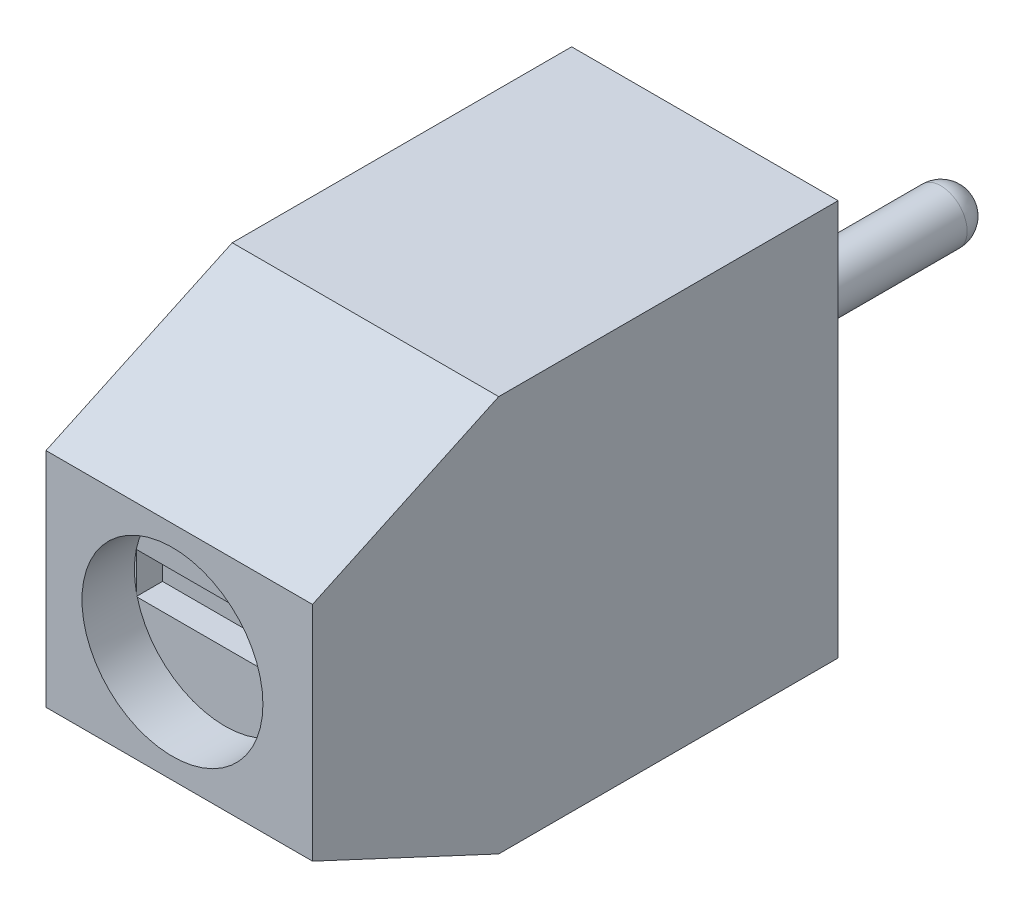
ISO-10303-21;
HEADER;
FILE_DESCRIPTION(('STEP AP214'),'2;1');
FILE_NAME('part.step','',(''),(''),'','','');
FILE_SCHEMA(('AUTOMOTIVE_DESIGN { 1 0 10303 214 1 1 1 1 }'));
ENDSEC;
DATA;
#1=APPLICATION_CONTEXT('core data for automotive mechanical design processes');
#2=APPLICATION_PROTOCOL_DEFINITION('international standard','automotive_design',2000,#1);
#3=PRODUCT_CONTEXT('',#1,'mechanical');
#4=PRODUCT('Part','Part','',(#3));
#5=PRODUCT_RELATED_PRODUCT_CATEGORY('part','',(#4));
#6=PRODUCT_DEFINITION_FORMATION('','',#4);
#7=PRODUCT_DEFINITION_CONTEXT('part definition',#1,'design');
#8=PRODUCT_DEFINITION('design','',#6,#7);
#9=PRODUCT_DEFINITION_SHAPE('','',#8);
#10=(LENGTH_UNIT() NAMED_UNIT(*) SI_UNIT(.MILLI.,.METRE.));
#11=(NAMED_UNIT(*) PLANE_ANGLE_UNIT() SI_UNIT($,.RADIAN.));
#12=(NAMED_UNIT(*) SI_UNIT($,.STERADIAN.) SOLID_ANGLE_UNIT());
#13=UNCERTAINTY_MEASURE_WITH_UNIT(LENGTH_MEASURE(1.E-05),#10,'distance_accuracy_value','');
#14=(GEOMETRIC_REPRESENTATION_CONTEXT(3) GLOBAL_UNCERTAINTY_ASSIGNED_CONTEXT((#13)) GLOBAL_UNIT_ASSIGNED_CONTEXT((#10,
#11,#12)) REPRESENTATION_CONTEXT('',''));
#15=CARTESIAN_POINT('',(0.,0.,0.));
#16=DIRECTION('',(0.,0.,1.));
#17=DIRECTION('',(1.,0.,0.));
#18=AXIS2_PLACEMENT_3D('',#15,#16,#17);
#19=CARTESIAN_POINT('',(2.535,3.2,3.23499999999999));
#20=DIRECTION('',(0.,-1.,0.));
#21=DIRECTION('',(0.,0.,-1.));
#22=AXIS2_PLACEMENT_3D('',#19,#20,#21);
#23=PLANE('',#22);
#24=DIRECTION('',(0.,0.,1.));
#25=VECTOR('',#24,1.);
#26=CARTESIAN_POINT('',(4.13961086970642,3.2,3.75756951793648));
#27=LINE('',#26,#25);
#28=CARTESIAN_POINT('',(4.13961086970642,3.2,2.75453256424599));
#29=VERTEX_POINT('',#28);
#30=CARTESIAN_POINT('',(4.13961086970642,3.2,3.71546743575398));
#31=VERTEX_POINT('',#30);
#32=EDGE_CURVE('E241',#29,#31,#27,.T.);
#33=ORIENTED_EDGE('',*,*,#32,.F.);
#34=CARTESIAN_POINT('',(2.535,3.2,3.23499999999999));
#35=DIRECTION('',(0.,-1.,0.));
#36=DIRECTION('',(0.,0.,-1.));
#37=AXIS2_PLACEMENT_3D('',#34,#35,#36);
#38=CIRCLE('',#37,1.675);
#39=EDGE_CURVE('E324',#29,#31,#38,.T.);
#40=ORIENTED_EDGE('',*,*,#39,.T.);
#41=EDGE_LOOP('',(#33,#40));
#42=FACE_BOUND('',#41,.T.);
#43=ADVANCED_FACE('F26',(#42),#23,.T.);
#44=DIRECTION('',(1.,0.,0.));
#45=VECTOR('',#44,1.);
#46=CARTESIAN_POINT('',(0.943602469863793,3.2,2.75453256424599));
#47=LINE('',#46,#45);
#48=CARTESIAN_POINT('',(0.943602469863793,3.2,2.75453256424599));
#49=VERTEX_POINT('',#48);
#50=EDGE_CURVE('E245',#49,#29,#47,.T.);
#51=ORIENTED_EDGE('',*,*,#50,.F.);
#52=DIRECTION('',(0.,0.,-1.));
#53=VECTOR('',#52,1.);
#54=CARTESIAN_POINT('',(0.943602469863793,3.2,3.75756951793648));
#55=LINE('',#54,#53);
#56=CARTESIAN_POINT('',(0.943602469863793,3.2,3.75756951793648));
#57=VERTEX_POINT('',#56);
#58=EDGE_CURVE('E169',#57,#49,#55,.T.);
#59=ORIENTED_EDGE('',*,*,#58,.F.);
#60=EDGE_CURVE('E328',#57,#29,#38,.T.);
#61=ORIENTED_EDGE('',*,*,#60,.T.);
#62=EDGE_LOOP('',(#51,#59,#61));
#63=FACE_BOUND('',#62,.T.);
#64=ADVANCED_FACE('F387',(#63),#23,.T.);
#65=CARTESIAN_POINT('',(2.41012041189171,3.775,9.02));
#66=DIRECTION('',(0.,0.,1.));
#67=DIRECTION('',(1.,0.,0.));
#68=AXIS2_PLACEMENT_3D('',#65,#66,#67);
#69=PLANE('',#68);
#70=DIRECTION('',(0.,-1.,0.));
#71=VECTOR('',#70,1.);
#72=CARTESIAN_POINT('',(0.720954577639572,4.12477676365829,9.02));
#73=LINE('',#72,#71);
#74=CARTESIAN_POINT('',(0.720954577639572,4.12477676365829,9.02));
#75=VERTEX_POINT('',#74);
#76=CARTESIAN_POINT('',(0.720954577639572,3.42522323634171,9.02));
#77=VERTEX_POINT('',#76);
#78=EDGE_CURVE('E210',#75,#77,#73,.T.);
#79=ORIENTED_EDGE('',*,*,#78,.F.);
#80=CARTESIAN_POINT('',(2.41012041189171,3.775,9.02));
#81=DIRECTION('',(0.,0.,1.));
#82=DIRECTION('',(1.,0.,0.));
#83=AXIS2_PLACEMENT_3D('',#80,#81,#82);
#84=CIRCLE('',#83,1.725);
#85=EDGE_CURVE('E282',#75,#77,#84,.T.);
#86=ORIENTED_EDGE('',*,*,#85,.T.);
#87=EDGE_LOOP('',(#79,#86));
#88=FACE_BOUND('',#87,.T.);
#89=ADVANCED_FACE('F366',(#88),#69,.T.);
#90=DIRECTION('',(1.,0.,0.));
#91=VECTOR('',#90,1.);
#92=CARTESIAN_POINT('',(0.720954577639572,3.34472594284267,9.02));
#93=LINE('',#92,#91);
#94=CARTESIAN_POINT('',(0.73964466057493,3.34472594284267,9.02));
#95=VERTEX_POINT('',#94);
#96=CARTESIAN_POINT('',(4.08059616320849,3.34472594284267,9.02));
#97=VERTEX_POINT('',#96);
#98=EDGE_CURVE('E197',#95,#97,#93,.T.);
#99=ORIENTED_EDGE('',*,*,#98,.F.);
#100=EDGE_CURVE('E373',#95,#97,#84,.T.);
#101=ORIENTED_EDGE('',*,*,#100,.T.);
#102=EDGE_LOOP('',(#99,#101));
#103=FACE_BOUND('',#102,.T.);
#104=ADVANCED_FACE('F378',(#103),#69,.T.);
#105=CARTESIAN_POINT('',(0.,0.,0.));
#106=DIRECTION('',(0.,0.,-1.));
#107=DIRECTION('',(-1.,0.,0.));
#108=AXIS2_PLACEMENT_3D('',#105,#106,#107);
#109=PLANE('',#108);
#110=DIRECTION('',(0.,1.,0.));
#111=VECTOR('',#110,1.);
#112=CARTESIAN_POINT('',(5.08,0.,0.));
#113=LINE('',#112,#111);
#114=CARTESIAN_POINT('',(5.08,0.,0.));
#115=VERTEX_POINT('',#114);
#116=CARTESIAN_POINT('',(5.08,7.55,0.));
#117=VERTEX_POINT('',#116);
#118=EDGE_CURVE('E251',#115,#117,#113,.T.);
#119=ORIENTED_EDGE('',*,*,#118,.F.);
#120=DIRECTION('',(1.,0.,0.));
#121=VECTOR('',#120,1.);
#122=CARTESIAN_POINT('',(0.,0.,0.));
#123=LINE('',#122,#121);
#124=CARTESIAN_POINT('',(0.,0.,0.));
#125=VERTEX_POINT('',#124);
#126=EDGE_CURVE('E260',#125,#115,#123,.T.);
#127=ORIENTED_EDGE('',*,*,#126,.F.);
#128=DIRECTION('',(0.,-1.,0.));
#129=VECTOR('',#128,1.);
#130=CARTESIAN_POINT('',(0.,0.,0.));
#131=LINE('',#130,#129);
#132=CARTESIAN_POINT('',(0.,7.55,0.));
#133=VERTEX_POINT('',#132);
#134=EDGE_CURVE('E280',#133,#125,#131,.T.);
#135=ORIENTED_EDGE('',*,*,#134,.F.);
#136=DIRECTION('',(-1.,0.,0.));
#137=VECTOR('',#136,1.);
#138=CARTESIAN_POINT('',(0.,7.55,0.));
#139=LINE('',#138,#137);
#140=EDGE_CURVE('E269',#117,#133,#139,.T.);
#141=ORIENTED_EDGE('',*,*,#140,.F.);
#142=EDGE_LOOP('',(#119,#127,#135,#141));
#143=FACE_BOUND('',#142,.T.);
#144=CARTESIAN_POINT('',(2.54,3.775,0.));
#145=DIRECTION('',(0.,0.,-1.));
#146=DIRECTION('',(-1.,0.,0.));
#147=AXIS2_PLACEMENT_3D('',#144,#145,#146);
#148=CIRCLE('',#147,0.5);
#149=CARTESIAN_POINT('',(2.04,3.775,0.));
#150=VERTEX_POINT('',#149);
#151=EDGE_CURVE('E332',#150,#150,#148,.T.);
#152=ORIENTED_EDGE('',*,*,#151,.F.);
#153=EDGE_LOOP('',(#152));
#154=FACE_BOUND('',#153,.T.);
#155=ADVANCED_FACE('F277',(#143,#154),#109,.T.);
#156=CARTESIAN_POINT('',(0.,0.,10.02));
#157=DIRECTION('',(1.,0.,0.));
#158=DIRECTION('',(0.,0.,-1.));
#159=AXIS2_PLACEMENT_3D('',#156,#157,#158);
#160=PLANE('',#159);
#161=DIRECTION('',(0.,-1.,0.));
#162=VECTOR('',#161,1.);
#163=CARTESIAN_POINT('',(0.,0.,10.02));
#164=LINE('',#163,#162);
#165=CARTESIAN_POINT('',(0.,5.89460781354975,10.02));
#166=VERTEX_POINT('',#165);
#167=CARTESIAN_POINT('',(0.,1.65539218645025,10.02));
#168=VERTEX_POINT('',#167);
#169=EDGE_CURVE('E266',#166,#168,#164,.T.);
#170=ORIENTED_EDGE('',*,*,#169,.F.);
#171=DIRECTION('',(0.,-0.422618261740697,0.906307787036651));
#172=VECTOR('',#171,1.);
#173=CARTESIAN_POINT('',(0.,5.89460781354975,10.02));
#174=LINE('',#173,#172);
#175=CARTESIAN_POINT('',(0.,7.55,6.46999999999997));
#176=VERTEX_POINT('',#175);
#177=EDGE_CURVE('E182',#166,#176,#174,.F.);
#178=ORIENTED_EDGE('',*,*,#177,.T.);
#179=DIRECTION('',(0.,0.,-1.));
#180=VECTOR('',#179,1.);
#181=CARTESIAN_POINT('',(0.,7.55,10.02));
#182=LINE('',#181,#180);
#183=EDGE_CURVE('E268',#176,#133,#182,.T.);
#184=ORIENTED_EDGE('',*,*,#183,.T.);
#185=ORIENTED_EDGE('',*,*,#134,.T.);
#186=DIRECTION('',(0.,0.,-1.));
#187=VECTOR('',#186,1.);
#188=CARTESIAN_POINT('',(0.,0.,10.02));
#189=LINE('',#188,#187);
#190=CARTESIAN_POINT('',(0.,0.,6.46999999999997));
#191=VERTEX_POINT('',#190);
#192=EDGE_CURVE('E187',#191,#125,#189,.T.);
#193=ORIENTED_EDGE('',*,*,#192,.F.);
#194=DIRECTION('',(0.,-0.422618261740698,-0.906307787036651));
#195=VECTOR('',#194,1.);
#196=CARTESIAN_POINT('',(0.,1.65539218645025,10.02));
#197=LINE('',#196,#195);
#198=EDGE_CURVE('E184',#191,#168,#197,.F.);
#199=ORIENTED_EDGE('',*,*,#198,.T.);
#200=EDGE_LOOP('',(#170,#178,#184,#185,#193,#199));
#201=FACE_BOUND('',#200,.T.);
#202=ADVANCED_FACE('F28',(#201),#160,.F.);
#203=CARTESIAN_POINT('',(0.,0.,10.02));
#204=DIRECTION('',(0.,1.,0.));
#205=DIRECTION('',(0.,0.,1.));
#206=AXIS2_PLACEMENT_3D('',#203,#204,#205);
#207=PLANE('',#206);
#208=DIRECTION('',(-1.,0.,0.));
#209=VECTOR('',#208,1.);
#210=CARTESIAN_POINT('',(4.63,0.,5.8));
#211=LINE('',#210,#209);
#212=CARTESIAN_POINT('',(4.63,0.,5.8));
#213=VERTEX_POINT('',#212);
#214=CARTESIAN_POINT('',(0.629999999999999,0.,5.8));
#215=VERTEX_POINT('',#214);
#216=EDGE_CURVE('E319',#213,#215,#211,.T.);
#217=ORIENTED_EDGE('',*,*,#216,.F.);
#218=DIRECTION('',(0.,0.,1.));
#219=VECTOR('',#218,1.);
#220=CARTESIAN_POINT('',(4.63,0.,5.8));
#221=LINE('',#220,#219);
#222=CARTESIAN_POINT('',(4.63,0.,0.800000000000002));
#223=VERTEX_POINT('',#222);
#224=EDGE_CURVE('E322',#223,#213,#221,.T.);
#225=ORIENTED_EDGE('',*,*,#224,.F.);
#226=DIRECTION('',(1.,0.,0.));
#227=VECTOR('',#226,1.);
#228=CARTESIAN_POINT('',(4.63,0.,0.800000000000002));
#229=LINE('',#228,#227);
#230=CARTESIAN_POINT('',(0.63,0.,0.800000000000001));
#231=VERTEX_POINT('',#230);
#232=EDGE_CURVE('E313',#231,#223,#229,.T.);
#233=ORIENTED_EDGE('',*,*,#232,.F.);
#234=DIRECTION('',(0.,0.,-1.));
#235=VECTOR('',#234,1.);
#236=CARTESIAN_POINT('',(0.629999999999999,0.,5.8));
#237=LINE('',#236,#235);
#238=EDGE_CURVE('E316',#215,#231,#237,.T.);
#239=ORIENTED_EDGE('',*,*,#238,.F.);
#240=EDGE_LOOP('',(#217,#225,#233,#239));
#241=FACE_BOUND('',#240,.T.);
#242=ORIENTED_EDGE('',*,*,#126,.T.);
#243=DIRECTION('',(0.,0.,1.));
#244=VECTOR('',#243,1.);
#245=CARTESIAN_POINT('',(5.08,0.,10.02));
#246=LINE('',#245,#244);
#247=CARTESIAN_POINT('',(5.08,0.,6.46999999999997));
#248=VERTEX_POINT('',#247);
#249=EDGE_CURVE('E179',#115,#248,#246,.T.);
#250=ORIENTED_EDGE('',*,*,#249,.T.);
#251=DIRECTION('',(-1.,0.,0.));
#252=VECTOR('',#251,1.);
#253=CARTESIAN_POINT('',(0.,0.,6.46999999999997));
#254=LINE('',#253,#252);
#255=EDGE_CURVE('E194',#248,#191,#254,.T.);
#256=ORIENTED_EDGE('',*,*,#255,.T.);
#257=ORIENTED_EDGE('',*,*,#192,.T.);
#258=EDGE_LOOP('',(#242,#250,#256,#257));
#259=FACE_BOUND('',#258,.T.);
#260=ADVANCED_FACE('F257',(#241,#259),#207,.F.);
#261=CARTESIAN_POINT('',(0.,7.55,10.02));
#262=DIRECTION('',(0.,-1.,0.));
#263=DIRECTION('',(1.,0.,0.));
#264=AXIS2_PLACEMENT_3D('',#261,#262,#263);
#265=PLANE('',#264);
#266=DIRECTION('',(1.,0.,0.));
#267=VECTOR('',#266,1.);
#268=CARTESIAN_POINT('',(0.,7.55,6.46999999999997));
#269=LINE('',#268,#267);
#270=CARTESIAN_POINT('',(5.08,7.55,6.46999999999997));
#271=VERTEX_POINT('',#270);
#272=EDGE_CURVE('E192',#176,#271,#269,.T.);
#273=ORIENTED_EDGE('',*,*,#272,.T.);
#274=DIRECTION('',(0.,0.,-1.));
#275=VECTOR('',#274,1.);
#276=CARTESIAN_POINT('',(5.08,7.55,10.02));
#277=LINE('',#276,#275);
#278=EDGE_CURVE('E164',#271,#117,#277,.T.);
#279=ORIENTED_EDGE('',*,*,#278,.T.);
#280=ORIENTED_EDGE('',*,*,#140,.T.);
#281=ORIENTED_EDGE('',*,*,#183,.F.);
#282=EDGE_LOOP('',(#273,#279,#280,#281));
#283=FACE_BOUND('',#282,.T.);
#284=ADVANCED_FACE('F564',(#283),#265,.F.);
#285=CARTESIAN_POINT('',(0.,0.,10.02));
#286=DIRECTION('',(0.,0.,-1.));
#287=DIRECTION('',(-1.,0.,0.));
#288=AXIS2_PLACEMENT_3D('',#285,#286,#287);
#289=PLANE('',#288);
#290=CARTESIAN_POINT('',(2.41012041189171,3.775,10.02));
#291=DIRECTION('',(0.,0.,1.));
#292=DIRECTION('',(1.,0.,0.));
#293=AXIS2_PLACEMENT_3D('',#290,#291,#292);
#294=CIRCLE('',#293,1.725);
#295=CARTESIAN_POINT('',(4.13512041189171,3.775,10.02));
#296=VERTEX_POINT('',#295);
#297=EDGE_CURVE('E289',#296,#296,#294,.T.);
#298=ORIENTED_EDGE('',*,*,#297,.F.);
#299=EDGE_LOOP('',(#298));
#300=FACE_BOUND('',#299,.T.);
#301=DIRECTION('',(1.,0.,0.));
#302=VECTOR('',#301,1.);
#303=CARTESIAN_POINT('',(0.,1.65539218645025,10.02));
#304=LINE('',#303,#302);
#305=CARTESIAN_POINT('',(5.08,1.65539218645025,10.02));
#306=VERTEX_POINT('',#305);
#307=EDGE_CURVE('E178',#168,#306,#304,.T.);
#308=ORIENTED_EDGE('',*,*,#307,.T.);
#309=DIRECTION('',(0.,-1.,0.));
#310=VECTOR('',#309,1.);
#311=CARTESIAN_POINT('',(5.08,9.15549118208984,10.02));
#312=LINE('',#311,#310);
#313=CARTESIAN_POINT('',(5.08,5.89460781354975,10.02));
#314=VERTEX_POINT('',#313);
#315=EDGE_CURVE('E40',#314,#306,#312,.T.);
#316=ORIENTED_EDGE('',*,*,#315,.F.);
#317=DIRECTION('',(-1.,0.,0.));
#318=VECTOR('',#317,1.);
#319=CARTESIAN_POINT('',(0.,5.89460781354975,10.02));
#320=LINE('',#319,#318);
#321=EDGE_CURVE('E175',#314,#166,#320,.T.);
#322=ORIENTED_EDGE('',*,*,#321,.T.);
#323=ORIENTED_EDGE('',*,*,#169,.T.);
#324=EDGE_LOOP('',(#308,#316,#322,#323));
#325=FACE_BOUND('',#324,.T.);
#326=ADVANCED_FACE('F173',(#300,#325),#289,.F.);
#327=CARTESIAN_POINT('',(0.,5.89460781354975,10.02));
#328=DIRECTION('',(0.,-0.906307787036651,-0.422618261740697));
#329=DIRECTION('',(0.,0.422618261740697,-0.906307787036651));
#330=AXIS2_PLACEMENT_3D('',#327,#328,#329);
#331=PLANE('',#330);
#332=DIRECTION('',(0.,0.422618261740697,-0.906307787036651));
#333=VECTOR('',#332,1.);
#334=CARTESIAN_POINT('',(5.08,5.89460781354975,10.02));
#335=LINE('',#334,#333);
#336=EDGE_CURVE('E161',#271,#314,#335,.F.);
#337=ORIENTED_EDGE('',*,*,#336,.F.);
#338=ORIENTED_EDGE('',*,*,#272,.F.);
#339=ORIENTED_EDGE('',*,*,#177,.F.);
#340=ORIENTED_EDGE('',*,*,#321,.F.);
#341=EDGE_LOOP('',(#337,#338,#339,#340));
#342=FACE_BOUND('',#341,.T.);
#343=ADVANCED_FACE('F181',(#342),#331,.F.);
#344=CARTESIAN_POINT('',(0.,1.65539218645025,10.02));
#345=DIRECTION('',(0.,0.906307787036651,-0.422618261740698));
#346=DIRECTION('',(0.,0.422618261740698,0.906307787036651));
#347=AXIS2_PLACEMENT_3D('',#344,#345,#346);
#348=PLANE('',#347);
#349=DIRECTION('',(0.,0.422618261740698,0.906307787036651));
#350=VECTOR('',#349,1.);
#351=CARTESIAN_POINT('',(5.08,1.65539218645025,10.02));
#352=LINE('',#351,#350);
#353=EDGE_CURVE('E11',#306,#248,#352,.F.);
#354=ORIENTED_EDGE('',*,*,#353,.F.);
#355=ORIENTED_EDGE('',*,*,#307,.F.);
#356=ORIENTED_EDGE('',*,*,#198,.F.);
#357=ORIENTED_EDGE('',*,*,#255,.F.);
#358=EDGE_LOOP('',(#354,#355,#356,#357));
#359=FACE_BOUND('',#358,.T.);
#360=ADVANCED_FACE('F264',(#359),#348,.F.);
#361=CARTESIAN_POINT('',(2.41012041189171,3.775,9.02));
#362=DIRECTION('',(0.,0.,1.));
#363=DIRECTION('',(1.,0.,0.));
#364=AXIS2_PLACEMENT_3D('',#361,#362,#363);
#365=CYLINDRICAL_SURFACE('',#364,1.725);
#366=ORIENTED_EDGE('',*,*,#85,.F.);
#367=EDGE_CURVE('E287',#97,#75,#84,.T.);
#368=ORIENTED_EDGE('',*,*,#367,.F.);
#369=ORIENTED_EDGE('',*,*,#100,.F.);
#370=EDGE_CURVE('E285',#77,#95,#84,.T.);
#371=ORIENTED_EDGE('',*,*,#370,.F.);
#372=EDGE_LOOP('',(#366,#368,#369,#371));
#373=FACE_BOUND('',#372,.T.);
#374=ORIENTED_EDGE('',*,*,#297,.T.);
#375=EDGE_LOOP('',(#374));
#376=FACE_BOUND('',#375,.T.);
#377=ADVANCED_FACE('F374',(#373,#376),#365,.F.);
#378=DIRECTION('',(0.,1.,0.));
#379=VECTOR('',#378,1.);
#380=CARTESIAN_POINT('',(4.08059616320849,4.12477676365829,9.02));
#381=LINE('',#380,#379);
#382=CARTESIAN_POINT('',(4.08059616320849,4.12477676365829,9.02));
#383=VERTEX_POINT('',#382);
#384=EDGE_CURVE('E209',#97,#383,#381,.T.);
#385=ORIENTED_EDGE('',*,*,#384,.F.);
#386=ORIENTED_EDGE('',*,*,#367,.T.);
#387=DIRECTION('',(-1.,0.,0.));
#388=VECTOR('',#387,1.);
#389=CARTESIAN_POINT('',(0.720954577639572,4.12477676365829,9.02));
#390=LINE('',#389,#388);
#391=EDGE_CURVE('E213',#383,#75,#390,.T.);
#392=ORIENTED_EDGE('',*,*,#391,.F.);
#393=EDGE_LOOP('',(#385,#386,#392));
#394=FACE_BOUND('',#393,.T.);
#395=ADVANCED_FACE('F369',(#394),#69,.T.);
#396=CARTESIAN_POINT('',(4.63,1.6,5.8));
#397=DIRECTION('',(1.,0.,0.));
#398=DIRECTION('',(0.,0.,-1.));
#399=AXIS2_PLACEMENT_3D('',#396,#397,#398);
#400=PLANE('',#399);
#401=ORIENTED_EDGE('',*,*,#224,.T.);
#402=DIRECTION('',(0.,-1.,0.));
#403=VECTOR('',#402,1.);
#404=CARTESIAN_POINT('',(4.63,1.6,5.8));
#405=LINE('',#404,#403);
#406=CARTESIAN_POINT('',(4.63,1.6,5.8));
#407=VERTEX_POINT('',#406);
#408=EDGE_CURVE('E293',#407,#213,#405,.T.);
#409=ORIENTED_EDGE('',*,*,#408,.F.);
#410=DIRECTION('',(0.,0.,1.));
#411=VECTOR('',#410,1.);
#412=CARTESIAN_POINT('',(4.63,1.6,5.8));
#413=LINE('',#412,#411);
#414=CARTESIAN_POINT('',(4.63,1.6,0.800000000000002));
#415=VERTEX_POINT('',#414);
#416=EDGE_CURVE('E310',#415,#407,#413,.T.);
#417=ORIENTED_EDGE('',*,*,#416,.F.);
#418=DIRECTION('',(0.,-1.,0.));
#419=VECTOR('',#418,1.);
#420=CARTESIAN_POINT('',(4.63,1.6,0.800000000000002));
#421=LINE('',#420,#419);
#422=EDGE_CURVE('E292',#415,#223,#421,.T.);
#423=ORIENTED_EDGE('',*,*,#422,.T.);
#424=EDGE_LOOP('',(#401,#409,#417,#423));
#425=FACE_BOUND('',#424,.T.);
#426=ADVANCED_FACE('F391',(#425),#400,.F.);
#427=CARTESIAN_POINT('',(4.63,1.6,0.800000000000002));
#428=DIRECTION('',(0.,0.,-1.));
#429=DIRECTION('',(-1.,0.,0.));
#430=AXIS2_PLACEMENT_3D('',#427,#428,#429);
#431=PLANE('',#430);
#432=ORIENTED_EDGE('',*,*,#232,.T.);
#433=ORIENTED_EDGE('',*,*,#422,.F.);
#434=DIRECTION('',(1.,0.,0.));
#435=VECTOR('',#434,1.);
#436=CARTESIAN_POINT('',(4.63,1.6,0.800000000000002));
#437=LINE('',#436,#435);
#438=CARTESIAN_POINT('',(0.63,1.6,0.800000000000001));
#439=VERTEX_POINT('',#438);
#440=EDGE_CURVE('E297',#439,#415,#437,.T.);
#441=ORIENTED_EDGE('',*,*,#440,.F.);
#442=DIRECTION('',(0.,-1.,0.));
#443=VECTOR('',#442,1.);
#444=CARTESIAN_POINT('',(0.63,1.6,0.800000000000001));
#445=LINE('',#444,#443);
#446=EDGE_CURVE('E299',#439,#231,#445,.T.);
#447=ORIENTED_EDGE('',*,*,#446,.T.);
#448=EDGE_LOOP('',(#432,#433,#441,#447));
#449=FACE_BOUND('',#448,.T.);
#450=ADVANCED_FACE('F614',(#449),#431,.F.);
#451=CARTESIAN_POINT('',(0.629999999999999,1.6,5.8));
#452=DIRECTION('',(-1.,0.,0.));
#453=DIRECTION('',(0.,0.,1.));
#454=AXIS2_PLACEMENT_3D('',#451,#452,#453);
#455=PLANE('',#454);
#456=ORIENTED_EDGE('',*,*,#238,.T.);
#457=ORIENTED_EDGE('',*,*,#446,.F.);
#458=DIRECTION('',(0.,0.,-1.));
#459=VECTOR('',#458,1.);
#460=CARTESIAN_POINT('',(0.629999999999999,1.6,5.8));
#461=LINE('',#460,#459);
#462=CARTESIAN_POINT('',(0.629999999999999,1.6,5.8));
#463=VERTEX_POINT('',#462);
#464=EDGE_CURVE('E304',#463,#439,#461,.T.);
#465=ORIENTED_EDGE('',*,*,#464,.F.);
#466=DIRECTION('',(0.,-1.,0.));
#467=VECTOR('',#466,1.);
#468=CARTESIAN_POINT('',(0.629999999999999,1.6,5.8));
#469=LINE('',#468,#467);
#470=EDGE_CURVE('E296',#463,#215,#469,.T.);
#471=ORIENTED_EDGE('',*,*,#470,.T.);
#472=EDGE_LOOP('',(#456,#457,#465,#471));
#473=FACE_BOUND('',#472,.T.);
#474=ADVANCED_FACE('F606',(#473),#455,.F.);
#475=CARTESIAN_POINT('',(4.63,1.6,5.8));
#476=DIRECTION('',(0.,0.,1.));
#477=DIRECTION('',(1.,0.,0.));
#478=AXIS2_PLACEMENT_3D('',#475,#476,#477);
#479=PLANE('',#478);
#480=ORIENTED_EDGE('',*,*,#216,.T.);
#481=ORIENTED_EDGE('',*,*,#470,.F.);
#482=DIRECTION('',(-1.,0.,0.));
#483=VECTOR('',#482,1.);
#484=CARTESIAN_POINT('',(4.63,1.6,5.8));
#485=LINE('',#484,#483);
#486=EDGE_CURVE('E307',#407,#463,#485,.T.);
#487=ORIENTED_EDGE('',*,*,#486,.F.);
#488=ORIENTED_EDGE('',*,*,#408,.T.);
#489=EDGE_LOOP('',(#480,#481,#487,#488));
#490=FACE_BOUND('',#489,.T.);
#491=ADVANCED_FACE('F598',(#490),#479,.F.);
#492=CARTESIAN_POINT('',(4.63,1.6,0.800000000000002));
#493=DIRECTION('',(0.,1.,0.));
#494=DIRECTION('',(0.,0.,1.));
#495=AXIS2_PLACEMENT_3D('',#492,#493,#494);
#496=PLANE('',#495);
#497=CARTESIAN_POINT('',(2.535,1.6,3.23499999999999));
#498=DIRECTION('',(0.,-1.,0.));
#499=DIRECTION('',(0.,0.,-1.));
#500=AXIS2_PLACEMENT_3D('',#497,#498,#499);
#501=CIRCLE('',#500,1.675);
#502=CARTESIAN_POINT('',(2.535,1.6,1.55999999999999));
#503=VERTEX_POINT('',#502);
#504=EDGE_CURVE('E329',#503,#503,#501,.T.);
#505=ORIENTED_EDGE('',*,*,#504,.F.);
#506=EDGE_LOOP('',(#505));
#507=FACE_BOUND('',#506,.T.);
#508=ORIENTED_EDGE('',*,*,#416,.T.);
#509=ORIENTED_EDGE('',*,*,#486,.T.);
#510=ORIENTED_EDGE('',*,*,#464,.T.);
#511=ORIENTED_EDGE('',*,*,#440,.T.);
#512=EDGE_LOOP('',(#508,#509,#510,#511));
#513=FACE_BOUND('',#512,.T.);
#514=ADVANCED_FACE('F414',(#507,#513),#496,.F.);
#515=CARTESIAN_POINT('',(2.535,3.2,3.23499999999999));
#516=DIRECTION('',(0.,-1.,0.));
#517=DIRECTION('',(0.,0.,-1.));
#518=AXIS2_PLACEMENT_3D('',#515,#516,#517);
#519=CYLINDRICAL_SURFACE('',#518,1.675);
#520=ORIENTED_EDGE('',*,*,#39,.F.);
#521=ORIENTED_EDGE('',*,*,#60,.F.);
#522=CARTESIAN_POINT('',(4.12639753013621,3.2,3.75756951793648));
#523=VERTEX_POINT('',#522);
#524=EDGE_CURVE('E419',#523,#57,#38,.T.);
#525=ORIENTED_EDGE('',*,*,#524,.F.);
#526=EDGE_CURVE('E327',#31,#523,#38,.T.);
#527=ORIENTED_EDGE('',*,*,#526,.F.);
#528=EDGE_LOOP('',(#520,#521,#525,#527));
#529=FACE_BOUND('',#528,.T.);
#530=ORIENTED_EDGE('',*,*,#504,.T.);
#531=EDGE_LOOP('',(#530));
#532=FACE_BOUND('',#531,.T.);
#533=ADVANCED_FACE('F406',(#529,#532),#519,.F.);
#534=DIRECTION('',(-1.,0.,0.));
#535=VECTOR('',#534,1.);
#536=CARTESIAN_POINT('',(0.943602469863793,3.2,3.75756951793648));
#537=LINE('',#536,#535);
#538=EDGE_CURVE('E34',#523,#57,#537,.T.);
#539=ORIENTED_EDGE('',*,*,#538,.F.);
#540=ORIENTED_EDGE('',*,*,#524,.T.);
#541=EDGE_LOOP('',(#539,#540));
#542=FACE_BOUND('',#541,.T.);
#543=ADVANCED_FACE('F395',(#542),#23,.T.);
#544=CARTESIAN_POINT('',(2.54,3.775,-5.));
#545=DIRECTION('',(0.,0.,1.));
#546=DIRECTION('',(1.,0.,0.));
#547=AXIS2_PLACEMENT_3D('',#544,#545,#546);
#548=CYLINDRICAL_SURFACE('',#547,0.5);
#549=CARTESIAN_POINT('',(2.54,3.775,-4.5));
#550=DIRECTION('',(0.,0.,1.));
#551=DIRECTION('',(1.,0.,0.));
#552=AXIS2_PLACEMENT_3D('',#549,#550,#551);
#553=CIRCLE('',#552,0.5);
#554=CARTESIAN_POINT('',(3.04,3.775,-4.5));
#555=VERTEX_POINT('',#554);
#556=EDGE_CURVE('E195',#555,#555,#553,.T.);
#557=ORIENTED_EDGE('',*,*,#556,.T.);
#558=EDGE_LOOP('',(#557));
#559=FACE_BOUND('',#558,.T.);
#560=ORIENTED_EDGE('',*,*,#151,.T.);
#561=EDGE_LOOP('',(#560));
#562=FACE_BOUND('',#561,.T.);
#563=ADVANCED_FACE('F405',(#559,#562),#548,.T.);
#564=CARTESIAN_POINT('',(2.54,3.775,-4.5));
#565=DIRECTION('',(0.,0.,1.));
#566=DIRECTION('',(1.,0.,0.));
#567=AXIS2_PLACEMENT_3D('',#564,#565,#566);
#568=SPHERICAL_SURFACE('',#567,0.5);
#569=ORIENTED_EDGE('',*,*,#556,.F.);
#570=EDGE_LOOP('',(#569));
#571=FACE_BOUND('',#570,.T.);
#572=ADVANCED_FACE('F413',(#571),#568,.T.);
#573=CARTESIAN_POINT('',(0.720954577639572,4.12477676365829,8.52));
#574=DIRECTION('',(-1.,0.,0.));
#575=DIRECTION('',(0.,0.,1.));
#576=AXIS2_PLACEMENT_3D('',#573,#574,#575);
#577=PLANE('',#576);
#578=ORIENTED_EDGE('',*,*,#78,.T.);
#579=CARTESIAN_POINT('',(0.720954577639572,3.34472594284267,9.02));
#580=VERTEX_POINT('',#579);
#581=EDGE_CURVE('E215',#77,#580,#73,.T.);
#582=ORIENTED_EDGE('',*,*,#581,.T.);
#583=DIRECTION('',(0.,0.,1.));
#584=VECTOR('',#583,1.);
#585=CARTESIAN_POINT('',(0.720954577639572,3.34472594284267,8.52));
#586=LINE('',#585,#584);
#587=CARTESIAN_POINT('',(0.720954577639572,3.34472594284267,8.52));
#588=VERTEX_POINT('',#587);
#589=EDGE_CURVE('E336',#588,#580,#586,.T.);
#590=ORIENTED_EDGE('',*,*,#589,.F.);
#591=DIRECTION('',(0.,-1.,0.));
#592=VECTOR('',#591,1.);
#593=CARTESIAN_POINT('',(0.720954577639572,4.12477676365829,8.52));
#594=LINE('',#593,#592);
#595=CARTESIAN_POINT('',(0.720954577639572,4.12477676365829,8.52));
#596=VERTEX_POINT('',#595);
#597=EDGE_CURVE('E353',#596,#588,#594,.T.);
#598=ORIENTED_EDGE('',*,*,#597,.F.);
#599=DIRECTION('',(0.,0.,1.));
#600=VECTOR('',#599,1.);
#601=CARTESIAN_POINT('',(0.720954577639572,4.12477676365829,8.52));
#602=LINE('',#601,#600);
#603=EDGE_CURVE('E335',#596,#75,#602,.T.);
#604=ORIENTED_EDGE('',*,*,#603,.T.);
#605=EDGE_LOOP('',(#578,#582,#590,#598,#604));
#606=FACE_BOUND('',#605,.T.);
#607=ADVANCED_FACE('F467',(#606),#577,.F.);
#608=CARTESIAN_POINT('',(0.720954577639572,4.12477676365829,8.52));
#609=DIRECTION('',(0.,1.,0.));
#610=DIRECTION('',(0.,0.,1.));
#611=AXIS2_PLACEMENT_3D('',#608,#609,#610);
#612=PLANE('',#611);
#613=ORIENTED_EDGE('',*,*,#391,.T.);
#614=ORIENTED_EDGE('',*,*,#603,.F.);
#615=DIRECTION('',(-1.,0.,0.));
#616=VECTOR('',#615,1.);
#617=CARTESIAN_POINT('',(0.720954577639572,4.12477676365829,8.52));
#618=LINE('',#617,#616);
#619=CARTESIAN_POINT('',(4.08059616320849,4.12477676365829,8.52));
#620=VERTEX_POINT('',#619);
#621=EDGE_CURVE('E339',#620,#596,#618,.T.);
#622=ORIENTED_EDGE('',*,*,#621,.F.);
#623=DIRECTION('',(0.,0.,1.));
#624=VECTOR('',#623,1.);
#625=CARTESIAN_POINT('',(4.08059616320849,4.12477676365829,8.52));
#626=LINE('',#625,#624);
#627=EDGE_CURVE('E341',#620,#383,#626,.T.);
#628=ORIENTED_EDGE('',*,*,#627,.T.);
#629=EDGE_LOOP('',(#613,#614,#622,#628));
#630=FACE_BOUND('',#629,.T.);
#631=ADVANCED_FACE('F359',(#630),#612,.F.);
#632=CARTESIAN_POINT('',(4.08059616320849,4.12477676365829,8.52));
#633=DIRECTION('',(1.,0.,0.));
#634=DIRECTION('',(0.,0.,-1.));
#635=AXIS2_PLACEMENT_3D('',#632,#633,#634);
#636=PLANE('',#635);
#637=ORIENTED_EDGE('',*,*,#384,.T.);
#638=ORIENTED_EDGE('',*,*,#627,.F.);
#639=DIRECTION('',(0.,1.,0.));
#640=VECTOR('',#639,1.);
#641=CARTESIAN_POINT('',(4.08059616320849,4.12477676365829,8.52));
#642=LINE('',#641,#640);
#643=CARTESIAN_POINT('',(4.08059616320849,3.34472594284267,8.52));
#644=VERTEX_POINT('',#643);
#645=EDGE_CURVE('E347',#644,#620,#642,.T.);
#646=ORIENTED_EDGE('',*,*,#645,.F.);
#647=DIRECTION('',(0.,0.,1.));
#648=VECTOR('',#647,1.);
#649=CARTESIAN_POINT('',(4.08059616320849,3.34472594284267,8.52));
#650=LINE('',#649,#648);
#651=EDGE_CURVE('E338',#644,#97,#650,.T.);
#652=ORIENTED_EDGE('',*,*,#651,.T.);
#653=EDGE_LOOP('',(#637,#638,#646,#652));
#654=FACE_BOUND('',#653,.T.);
#655=ADVANCED_FACE('F466',(#654),#636,.F.);
#656=CARTESIAN_POINT('',(0.720954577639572,3.34472594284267,8.52));
#657=DIRECTION('',(0.,-1.,0.));
#658=DIRECTION('',(0.,0.,-1.));
#659=AXIS2_PLACEMENT_3D('',#656,#657,#658);
#660=PLANE('',#659);
#661=EDGE_CURVE('E201',#580,#95,#93,.T.);
#662=ORIENTED_EDGE('',*,*,#661,.T.);
#663=ORIENTED_EDGE('',*,*,#98,.T.);
#664=ORIENTED_EDGE('',*,*,#651,.F.);
#665=DIRECTION('',(1.,0.,0.));
#666=VECTOR('',#665,1.);
#667=CARTESIAN_POINT('',(0.720954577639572,3.34472594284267,8.52));
#668=LINE('',#667,#666);
#669=EDGE_CURVE('E350',#588,#644,#668,.T.);
#670=ORIENTED_EDGE('',*,*,#669,.F.);
#671=ORIENTED_EDGE('',*,*,#589,.T.);
#672=EDGE_LOOP('',(#662,#663,#664,#670,#671));
#673=FACE_BOUND('',#672,.T.);
#674=ADVANCED_FACE('F462',(#673),#660,.F.);
#675=CARTESIAN_POINT('',(0.720954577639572,3.34472594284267,8.52));
#676=DIRECTION('',(0.,0.,1.));
#677=DIRECTION('',(1.,0.,0.));
#678=AXIS2_PLACEMENT_3D('',#675,#676,#677);
#679=PLANE('',#678);
#680=ORIENTED_EDGE('',*,*,#597,.T.);
#681=ORIENTED_EDGE('',*,*,#669,.T.);
#682=ORIENTED_EDGE('',*,*,#645,.T.);
#683=ORIENTED_EDGE('',*,*,#621,.T.);
#684=EDGE_LOOP('',(#680,#681,#682,#683));
#685=FACE_BOUND('',#684,.T.);
#686=ADVANCED_FACE('F459',(#685),#679,.T.);
#687=CARTESIAN_POINT('',(0.720954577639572,3.34472594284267,9.02));
#688=DIRECTION('',(0.,0.,1.));
#689=DIRECTION('',(1.,0.,0.));
#690=AXIS2_PLACEMENT_3D('',#687,#688,#689);
#691=PLANE('',#690);
#692=ORIENTED_EDGE('',*,*,#370,.T.);
#693=ORIENTED_EDGE('',*,*,#661,.F.);
#694=ORIENTED_EDGE('',*,*,#581,.F.);
#695=EDGE_LOOP('',(#692,#693,#694));
#696=FACE_BOUND('',#695,.T.);
#697=ADVANCED_FACE('F457',(#696),#691,.F.);
#698=CARTESIAN_POINT('',(0.943602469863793,3.7,3.75756951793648));
#699=DIRECTION('',(-1.,0.,0.));
#700=DIRECTION('',(0.,0.,1.));
#701=AXIS2_PLACEMENT_3D('',#698,#699,#700);
#702=PLANE('',#701);
#703=ORIENTED_EDGE('',*,*,#58,.T.);
#704=DIRECTION('',(0.,-1.,0.));
#705=VECTOR('',#704,1.);
#706=CARTESIAN_POINT('',(0.943602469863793,3.7,2.75453256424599));
#707=LINE('',#706,#705);
#708=CARTESIAN_POINT('',(0.943602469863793,3.7,2.75453256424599));
#709=VERTEX_POINT('',#708);
#710=EDGE_CURVE('E221',#709,#49,#707,.T.);
#711=ORIENTED_EDGE('',*,*,#710,.F.);
#712=DIRECTION('',(0.,0.,-1.));
#713=VECTOR('',#712,1.);
#714=CARTESIAN_POINT('',(0.943602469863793,3.7,3.75756951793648));
#715=LINE('',#714,#713);
#716=CARTESIAN_POINT('',(0.943602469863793,3.7,3.75756951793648));
#717=VERTEX_POINT('',#716);
#718=EDGE_CURVE('E238',#717,#709,#715,.T.);
#719=ORIENTED_EDGE('',*,*,#718,.F.);
#720=DIRECTION('',(0.,-1.,0.));
#721=VECTOR('',#720,1.);
#722=CARTESIAN_POINT('',(0.943602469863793,3.7,3.75756951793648));
#723=LINE('',#722,#721);
#724=EDGE_CURVE('E219',#717,#57,#723,.T.);
#725=ORIENTED_EDGE('',*,*,#724,.T.);
#726=EDGE_LOOP('',(#703,#711,#719,#725));
#727=FACE_BOUND('',#726,.T.);
#728=ADVANCED_FACE('F435',(#727),#702,.F.);
#729=CARTESIAN_POINT('',(0.943602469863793,3.7,3.75756951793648));
#730=DIRECTION('',(0.,0.,1.));
#731=DIRECTION('',(1.,0.,0.));
#732=AXIS2_PLACEMENT_3D('',#729,#730,#731);
#733=PLANE('',#732);
#734=CARTESIAN_POINT('',(4.13961086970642,3.2,3.75756951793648));
#735=VERTEX_POINT('',#734);
#736=EDGE_CURVE('E48',#735,#523,#537,.T.);
#737=ORIENTED_EDGE('',*,*,#736,.T.);
#738=ORIENTED_EDGE('',*,*,#538,.T.);
#739=ORIENTED_EDGE('',*,*,#724,.F.);
#740=DIRECTION('',(-1.,0.,0.));
#741=VECTOR('',#740,1.);
#742=CARTESIAN_POINT('',(0.943602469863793,3.7,3.75756951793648));
#743=LINE('',#742,#741);
#744=CARTESIAN_POINT('',(4.13961086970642,3.7,3.75756951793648));
#745=VERTEX_POINT('',#744);
#746=EDGE_CURVE('E224',#745,#717,#743,.T.);
#747=ORIENTED_EDGE('',*,*,#746,.F.);
#748=DIRECTION('',(0.,-1.,0.));
#749=VECTOR('',#748,1.);
#750=CARTESIAN_POINT('',(4.13961086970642,3.7,3.75756951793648));
#751=LINE('',#750,#749);
#752=EDGE_CURVE('E226',#745,#735,#751,.T.);
#753=ORIENTED_EDGE('',*,*,#752,.T.);
#754=EDGE_LOOP('',(#737,#738,#739,#747,#753));
#755=FACE_BOUND('',#754,.T.);
#756=ADVANCED_FACE('F437',(#755),#733,.F.);
#757=CARTESIAN_POINT('',(4.13961086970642,3.7,3.75756951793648));
#758=DIRECTION('',(1.,0.,0.));
#759=DIRECTION('',(0.,0.,-1.));
#760=AXIS2_PLACEMENT_3D('',#757,#758,#759);
#761=PLANE('',#760);
#762=ORIENTED_EDGE('',*,*,#32,.T.);
#763=EDGE_CURVE('E244',#31,#735,#27,.T.);
#764=ORIENTED_EDGE('',*,*,#763,.T.);
#765=ORIENTED_EDGE('',*,*,#752,.F.);
#766=DIRECTION('',(0.,0.,1.));
#767=VECTOR('',#766,1.);
#768=CARTESIAN_POINT('',(4.13961086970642,3.7,3.75756951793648));
#769=LINE('',#768,#767);
#770=CARTESIAN_POINT('',(4.13961086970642,3.7,2.75453256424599));
#771=VERTEX_POINT('',#770);
#772=EDGE_CURVE('E232',#771,#745,#769,.T.);
#773=ORIENTED_EDGE('',*,*,#772,.F.);
#774=DIRECTION('',(0.,-1.,0.));
#775=VECTOR('',#774,1.);
#776=CARTESIAN_POINT('',(4.13961086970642,3.7,2.75453256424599));
#777=LINE('',#776,#775);
#778=EDGE_CURVE('E223',#771,#29,#777,.T.);
#779=ORIENTED_EDGE('',*,*,#778,.T.);
#780=EDGE_LOOP('',(#762,#764,#765,#773,#779));
#781=FACE_BOUND('',#780,.T.);
#782=ADVANCED_FACE('F428',(#781),#761,.F.);
#783=CARTESIAN_POINT('',(0.943602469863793,3.7,2.75453256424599));
#784=DIRECTION('',(0.,0.,-1.));
#785=DIRECTION('',(-1.,0.,0.));
#786=AXIS2_PLACEMENT_3D('',#783,#784,#785);
#787=PLANE('',#786);
#788=ORIENTED_EDGE('',*,*,#50,.T.);
#789=ORIENTED_EDGE('',*,*,#778,.F.);
#790=DIRECTION('',(1.,0.,0.));
#791=VECTOR('',#790,1.);
#792=CARTESIAN_POINT('',(0.943602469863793,3.7,2.75453256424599));
#793=LINE('',#792,#791);
#794=EDGE_CURVE('E235',#709,#771,#793,.T.);
#795=ORIENTED_EDGE('',*,*,#794,.F.);
#796=ORIENTED_EDGE('',*,*,#710,.T.);
#797=EDGE_LOOP('',(#788,#789,#795,#796));
#798=FACE_BOUND('',#797,.T.);
#799=ADVANCED_FACE('F432',(#798),#787,.F.);
#800=CARTESIAN_POINT('',(0.943602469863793,3.7,2.75453256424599));
#801=DIRECTION('',(0.,-1.,0.));
#802=DIRECTION('',(0.,0.,-1.));
#803=AXIS2_PLACEMENT_3D('',#800,#801,#802);
#804=PLANE('',#803);
#805=ORIENTED_EDGE('',*,*,#718,.T.);
#806=ORIENTED_EDGE('',*,*,#794,.T.);
#807=ORIENTED_EDGE('',*,*,#772,.T.);
#808=ORIENTED_EDGE('',*,*,#746,.T.);
#809=EDGE_LOOP('',(#805,#806,#807,#808));
#810=FACE_BOUND('',#809,.T.);
#811=ADVANCED_FACE('F439',(#810),#804,.T.);
#812=CARTESIAN_POINT('',(0.943602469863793,3.2,2.75453256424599));
#813=DIRECTION('',(0.,-1.,0.));
#814=DIRECTION('',(0.,0.,-1.));
#815=AXIS2_PLACEMENT_3D('',#812,#813,#814);
#816=PLANE('',#815);
#817=ORIENTED_EDGE('',*,*,#526,.T.);
#818=ORIENTED_EDGE('',*,*,#736,.F.);
#819=ORIENTED_EDGE('',*,*,#763,.F.);
#820=EDGE_LOOP('',(#817,#818,#819));
#821=FACE_BOUND('',#820,.T.);
#822=ADVANCED_FACE('F441',(#821),#816,.F.);
#823=CARTESIAN_POINT('',(5.08,9.15549118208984,-5.));
#824=DIRECTION('',(-1.,0.,0.));
#825=DIRECTION('',(0.,-1.,0.));
#826=AXIS2_PLACEMENT_3D('',#823,#824,#825);
#827=PLANE('',#826);
#828=ORIENTED_EDGE('',*,*,#336,.T.);
#829=ORIENTED_EDGE('',*,*,#315,.T.);
#830=ORIENTED_EDGE('',*,*,#353,.T.);
#831=ORIENTED_EDGE('',*,*,#249,.F.);
#832=ORIENTED_EDGE('',*,*,#118,.T.);
#833=ORIENTED_EDGE('',*,*,#278,.F.);
#834=EDGE_LOOP('',(#828,#829,#830,#831,#832,#833));
#835=FACE_BOUND('',#834,.T.);
#836=ADVANCED_FACE('F162',(#835),#827,.F.);
#837=CLOSED_SHELL('',(#43,#64,#89,#104,#155,#202,#260,#284,#326,#343,#360,#377,#395,#426,#450,
#474,#491,#514,#533,#543,#563,#572,#607,#631,#655,#674,#686,#697,#728,#756,#782,#799,#811,#822,#836));
#838=MANIFOLD_SOLID_BREP('B2',#837);
#839=ADVANCED_BREP_SHAPE_REPRESENTATION('',(#18,#838),#14);
#840=SHAPE_DEFINITION_REPRESENTATION(#9,#839);
ENDSEC;
END-ISO-10303-21;
